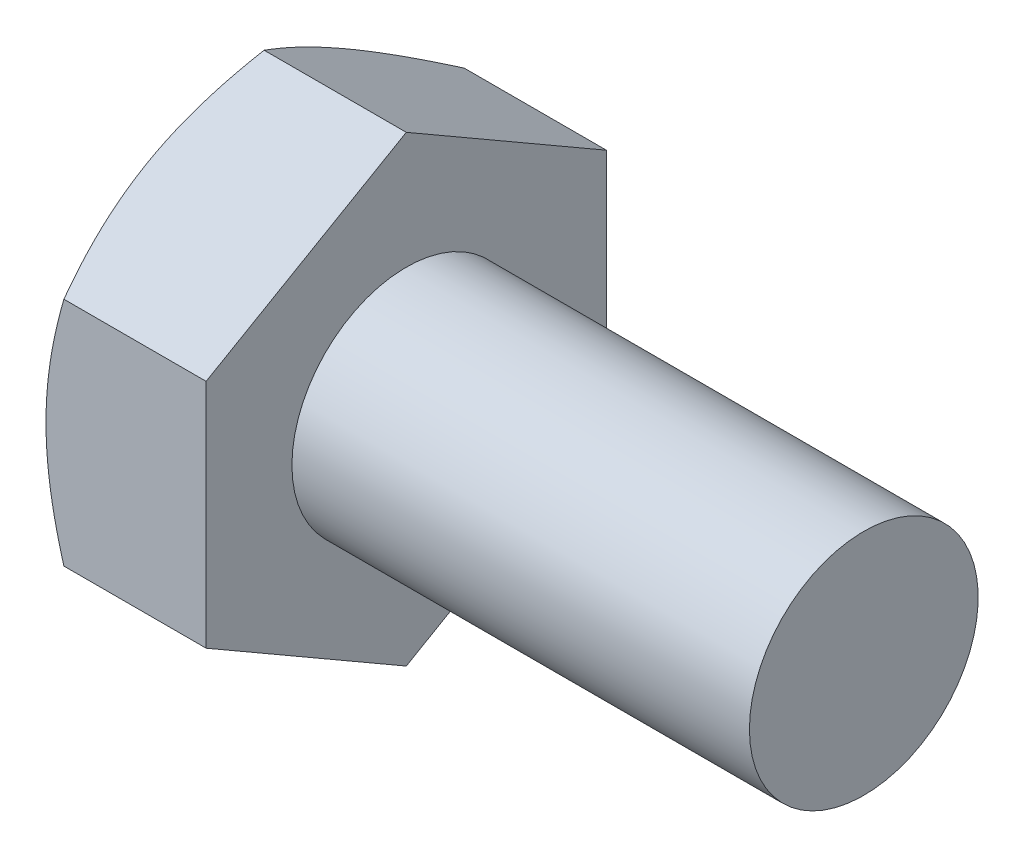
from build123d import *

# Parameters (mm, degrees)
SKETCH1_W           = 8
SKETCH1_H           = 2
BOSS_EXTRUDE1_DEPTH = 2.8


with BuildPart() as part:
    # Sketch1 → Revolve1 (revolve)
    with BuildSketch(Plane.XY, mode=Mode.PRIVATE) as revolve1_sk:
        with Locations((4, 1)):
            Rectangle(SKETCH1_W, SKETCH1_H)
    revolve(revolve1_sk.sketch.rotate(Axis((0, 0, 0), (1, 0, 0)), 90), axis=Axis((0, 0, 0), (1, 0, 0)))

    # Sketch2 → Boss-Extrude1 (add)
    with BuildSketch(Plane.ZY):
        Polygon((0, 4.041451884), (-3.5, 2.020725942), (-3.5, -2.020725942), (0, -4.041451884), (3.5, -2.020725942), (3.5, 2.020725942), align=None)
    extrude(amount=BOSS_EXTRUDE1_DEPTH)

    # Sketch3 → Cut-Revolve1 (revolve, cut)
    with BuildSketch(Plane.XY):
        Polygon((-2.8, 4.041451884), (-2.8, 3.5), (-2.487, 4.041451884), align=None)
    revolve(axis=Axis((-2.8, 0, 0), (1, 0, 0)), mode=Mode.SUBTRACT)


solid = part.part
